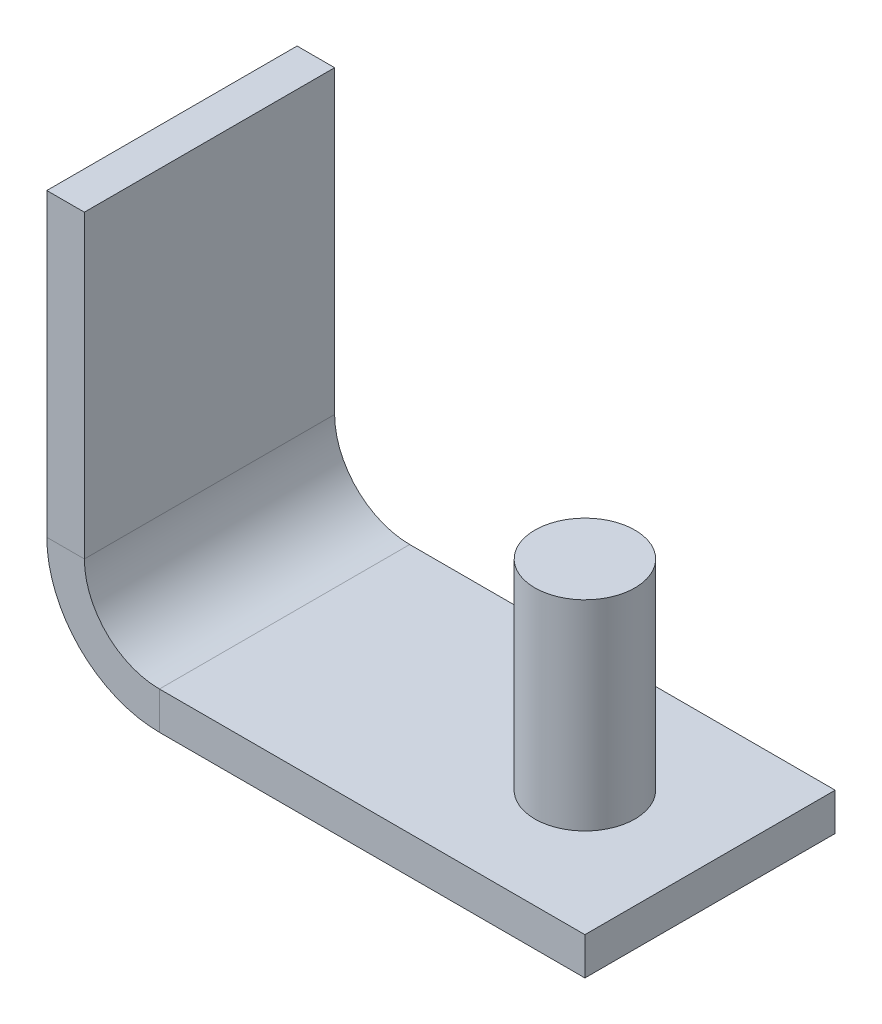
ISO-10303-21;
HEADER;
FILE_DESCRIPTION(('STEP AP214'),'2;1');
FILE_NAME('part.step','',(''),(''),'','','');
FILE_SCHEMA(('AUTOMOTIVE_DESIGN { 1 0 10303 214 1 1 1 1 }'));
ENDSEC;
DATA;
#1=APPLICATION_CONTEXT('core data for automotive mechanical design processes');
#2=APPLICATION_PROTOCOL_DEFINITION('international standard','automotive_design',2000,#1);
#3=PRODUCT_CONTEXT('',#1,'mechanical');
#4=PRODUCT('Part','Part','',(#3));
#5=PRODUCT_RELATED_PRODUCT_CATEGORY('part','',(#4));
#6=PRODUCT_DEFINITION_FORMATION('','',#4);
#7=PRODUCT_DEFINITION_CONTEXT('part definition',#1,'design');
#8=PRODUCT_DEFINITION('design','',#6,#7);
#9=PRODUCT_DEFINITION_SHAPE('','',#8);
#10=(LENGTH_UNIT() NAMED_UNIT(*) SI_UNIT(.MILLI.,.METRE.));
#11=(NAMED_UNIT(*) PLANE_ANGLE_UNIT() SI_UNIT($,.RADIAN.));
#12=(NAMED_UNIT(*) SI_UNIT($,.STERADIAN.) SOLID_ANGLE_UNIT());
#13=UNCERTAINTY_MEASURE_WITH_UNIT(LENGTH_MEASURE(1.E-05),#10,'distance_accuracy_value','');
#14=(GEOMETRIC_REPRESENTATION_CONTEXT(3) GLOBAL_UNCERTAINTY_ASSIGNED_CONTEXT((#13)) GLOBAL_UNIT_ASSIGNED_CONTEXT((#10,
#11,#12)) REPRESENTATION_CONTEXT('',''));
#15=CARTESIAN_POINT('',(0.,0.,0.));
#16=DIRECTION('',(0.,0.,1.));
#17=DIRECTION('',(1.,0.,0.));
#18=AXIS2_PLACEMENT_3D('',#15,#16,#17);
#19=CARTESIAN_POINT('',(6.00000000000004,0.,20.));
#20=DIRECTION('',(0.,0.,1.));
#21=DIRECTION('',(1.,0.,0.));
#22=AXIS2_PLACEMENT_3D('',#19,#20,#21);
#23=PLANE('',#22);
#24=DIRECTION('',(0.,-1.,0.));
#25=VECTOR('',#24,1.);
#26=CARTESIAN_POINT('',(6.00000000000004,0.,20.));
#27=LINE('',#26,#25);
#28=CARTESIAN_POINT('',(6.00000000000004,0.,20.));
#29=VERTEX_POINT('',#28);
#30=CARTESIAN_POINT('',(6.00000000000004,-3.,20.));
#31=VERTEX_POINT('',#30);
#32=EDGE_CURVE('E11',#29,#31,#27,.T.);
#33=ORIENTED_EDGE('',*,*,#32,.F.);
#34=CARTESIAN_POINT('',(6.,6.,20.));
#35=DIRECTION('',(0.,0.,1.));
#36=DIRECTION('',(-1.,0.,0.));
#37=AXIS2_PLACEMENT_3D('',#34,#35,#36);
#38=CIRCLE('',#37,6.);
#39=CARTESIAN_POINT('',(0.,6.00000000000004,20.));
#40=VERTEX_POINT('',#39);
#41=EDGE_CURVE('E133',#40,#29,#38,.T.);
#42=ORIENTED_EDGE('',*,*,#41,.F.);
#43=DIRECTION('',(1.,0.,0.));
#44=VECTOR('',#43,1.);
#45=CARTESIAN_POINT('',(-3.,6.00000000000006,20.));
#46=LINE('',#45,#44);
#47=CARTESIAN_POINT('',(-3.,6.00000000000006,20.));
#48=VERTEX_POINT('',#47);
#49=EDGE_CURVE('E44',#48,#40,#46,.T.);
#50=ORIENTED_EDGE('',*,*,#49,.F.);
#51=CARTESIAN_POINT('',(6.,6.,20.));
#52=DIRECTION('',(0.,0.,1.));
#53=DIRECTION('',(1.,0.,0.));
#54=AXIS2_PLACEMENT_3D('',#51,#52,#53);
#55=CIRCLE('',#54,9.);
#56=EDGE_CURVE('E126',#48,#31,#55,.T.);
#57=ORIENTED_EDGE('',*,*,#56,.T.);
#58=EDGE_LOOP('',(#33,#42,#50,#57));
#59=FACE_BOUND('',#58,.T.);
#60=ADVANCED_FACE('F36',(#59),#23,.T.);
#61=CARTESIAN_POINT('',(-3.,6.00000000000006,20.));
#62=DIRECTION('',(0.,0.,1.));
#63=DIRECTION('',(1.,0.,0.));
#64=AXIS2_PLACEMENT_3D('',#61,#62,#63);
#65=PLANE('',#64);
#66=DIRECTION('',(1.,0.,0.));
#67=VECTOR('',#66,1.);
#68=CARTESIAN_POINT('',(6.00000000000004,0.,20.));
#69=LINE('',#68,#67);
#70=CARTESIAN_POINT('',(40.,0.,20.));
#71=VERTEX_POINT('',#70);
#72=EDGE_CURVE('E183',#29,#71,#69,.T.);
#73=ORIENTED_EDGE('',*,*,#72,.F.);
#74=ORIENTED_EDGE('',*,*,#32,.T.);
#75=DIRECTION('',(1.,0.,0.));
#76=VECTOR('',#75,1.);
#77=CARTESIAN_POINT('',(6.00000000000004,-3.,20.));
#78=LINE('',#77,#76);
#79=CARTESIAN_POINT('',(40.,-3.,20.));
#80=VERTEX_POINT('',#79);
#81=EDGE_CURVE('E92',#31,#80,#78,.T.);
#82=ORIENTED_EDGE('',*,*,#81,.T.);
#83=DIRECTION('',(0.,-1.,0.));
#84=VECTOR('',#83,1.);
#85=CARTESIAN_POINT('',(40.,0.,20.));
#86=LINE('',#85,#84);
#87=EDGE_CURVE('E348',#71,#80,#86,.T.);
#88=ORIENTED_EDGE('',*,*,#87,.F.);
#89=EDGE_LOOP('',(#73,#74,#82,#88));
#90=FACE_BOUND('',#89,.T.);
#91=ADVANCED_FACE('F191',(#90),#65,.T.);
#92=CARTESIAN_POINT('',(0.,6.00000000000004,0.));
#93=DIRECTION('',(0.,0.,-1.));
#94=DIRECTION('',(-1.,0.,0.));
#95=AXIS2_PLACEMENT_3D('',#92,#93,#94);
#96=PLANE('',#95);
#97=DIRECTION('',(-1.,0.,0.));
#98=VECTOR('',#97,1.);
#99=CARTESIAN_POINT('',(0.,6.00000000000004,0.));
#100=LINE('',#99,#98);
#101=CARTESIAN_POINT('',(0.,6.00000000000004,0.));
#102=VERTEX_POINT('',#101);
#103=CARTESIAN_POINT('',(-3.,6.00000000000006,0.));
#104=VERTEX_POINT('',#103);
#105=EDGE_CURVE('E79',#102,#104,#100,.T.);
#106=ORIENTED_EDGE('',*,*,#105,.F.);
#107=CARTESIAN_POINT('',(6.,6.,0.));
#108=DIRECTION('',(0.,0.,1.));
#109=DIRECTION('',(-1.,0.,0.));
#110=AXIS2_PLACEMENT_3D('',#107,#108,#109);
#111=CIRCLE('',#110,6.);
#112=CARTESIAN_POINT('',(6.00000000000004,0.,0.));
#113=VERTEX_POINT('',#112);
#114=EDGE_CURVE('E149',#102,#113,#111,.T.);
#115=ORIENTED_EDGE('',*,*,#114,.T.);
#116=DIRECTION('',(0.,1.,0.));
#117=VECTOR('',#116,1.);
#118=CARTESIAN_POINT('',(6.00000000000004,-3.,0.));
#119=LINE('',#118,#117);
#120=CARTESIAN_POINT('',(6.00000000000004,-3.,0.));
#121=VERTEX_POINT('',#120);
#122=EDGE_CURVE('E86',#121,#113,#119,.T.);
#123=ORIENTED_EDGE('',*,*,#122,.F.);
#124=CARTESIAN_POINT('',(6.,6.,0.));
#125=DIRECTION('',(0.,0.,1.));
#126=DIRECTION('',(1.,0.,0.));
#127=AXIS2_PLACEMENT_3D('',#124,#125,#126);
#128=CIRCLE('',#127,9.);
#129=EDGE_CURVE('E156',#104,#121,#128,.T.);
#130=ORIENTED_EDGE('',*,*,#129,.F.);
#131=EDGE_LOOP('',(#106,#115,#123,#130));
#132=FACE_BOUND('',#131,.T.);
#133=ADVANCED_FACE('F189',(#132),#96,.T.);
#134=CARTESIAN_POINT('',(6.00000000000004,-3.,0.));
#135=DIRECTION('',(0.,0.,-1.));
#136=DIRECTION('',(-1.,0.,0.));
#137=AXIS2_PLACEMENT_3D('',#134,#135,#136);
#138=PLANE('',#137);
#139=DIRECTION('',(0.,-1.,0.));
#140=VECTOR('',#139,1.);
#141=CARTESIAN_POINT('',(0.,6.00000000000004,0.));
#142=LINE('',#141,#140);
#143=CARTESIAN_POINT('',(0.,30.,0.));
#144=VERTEX_POINT('',#143);
#145=EDGE_CURVE('E151',#144,#102,#142,.T.);
#146=ORIENTED_EDGE('',*,*,#145,.T.);
#147=ORIENTED_EDGE('',*,*,#105,.T.);
#148=DIRECTION('',(0.,1.,0.));
#149=VECTOR('',#148,1.);
#150=CARTESIAN_POINT('',(-3.,6.00000000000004,0.));
#151=LINE('',#150,#149);
#152=CARTESIAN_POINT('',(-3.,30.,0.));
#153=VERTEX_POINT('',#152);
#154=EDGE_CURVE('E154',#153,#104,#151,.F.);
#155=ORIENTED_EDGE('',*,*,#154,.F.);
#156=DIRECTION('',(1.,0.,0.));
#157=VECTOR('',#156,1.);
#158=CARTESIAN_POINT('',(-3.,30.,0.));
#159=LINE('',#158,#157);
#160=EDGE_CURVE('E114',#153,#144,#159,.T.);
#161=ORIENTED_EDGE('',*,*,#160,.T.);
#162=EDGE_LOOP('',(#146,#147,#155,#161));
#163=FACE_BOUND('',#162,.T.);
#164=ADVANCED_FACE('F185',(#163),#138,.T.);
#165=CARTESIAN_POINT('',(6.00000000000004,-3.,20.));
#166=DIRECTION('',(0.,1.,0.));
#167=DIRECTION('',(0.,0.,1.));
#168=AXIS2_PLACEMENT_3D('',#165,#166,#167);
#169=PLANE('',#168);
#170=DIRECTION('',(1.,0.,0.));
#171=VECTOR('',#170,1.);
#172=CARTESIAN_POINT('',(6.00000000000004,-3.,0.));
#173=LINE('',#172,#171);
#174=CARTESIAN_POINT('',(40.,-3.,0.));
#175=VERTEX_POINT('',#174);
#176=EDGE_CURVE('E139',#121,#175,#173,.T.);
#177=ORIENTED_EDGE('',*,*,#176,.T.);
#178=DIRECTION('',(0.,0.,-1.));
#179=VECTOR('',#178,1.);
#180=CARTESIAN_POINT('',(40.,-3.,20.));
#181=LINE('',#180,#179);
#182=EDGE_CURVE('E170',#80,#175,#181,.T.);
#183=ORIENTED_EDGE('',*,*,#182,.F.);
#184=ORIENTED_EDGE('',*,*,#81,.F.);
#185=DIRECTION('',(0.,0.,-1.));
#186=VECTOR('',#185,1.);
#187=CARTESIAN_POINT('',(6.00000000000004,-3.,20.));
#188=LINE('',#187,#186);
#189=EDGE_CURVE('E138',#31,#121,#188,.T.);
#190=ORIENTED_EDGE('',*,*,#189,.T.);
#191=EDGE_LOOP('',(#177,#183,#184,#190));
#192=FACE_BOUND('',#191,.T.);
#193=ADVANCED_FACE('F197',(#192),#169,.F.);
#194=CARTESIAN_POINT('',(40.,0.,20.));
#195=DIRECTION('',(1.,0.,0.));
#196=DIRECTION('',(0.,0.,-1.));
#197=AXIS2_PLACEMENT_3D('',#194,#195,#196);
#198=PLANE('',#197);
#199=DIRECTION('',(0.,-1.,0.));
#200=VECTOR('',#199,1.);
#201=CARTESIAN_POINT('',(40.,0.,0.));
#202=LINE('',#201,#200);
#203=CARTESIAN_POINT('',(40.,0.,0.));
#204=VERTEX_POINT('',#203);
#205=EDGE_CURVE('E142',#204,#175,#202,.T.);
#206=ORIENTED_EDGE('',*,*,#205,.F.);
#207=DIRECTION('',(0.,0.,-1.));
#208=VECTOR('',#207,1.);
#209=CARTESIAN_POINT('',(40.,0.,20.));
#210=LINE('',#209,#208);
#211=EDGE_CURVE('E168',#71,#204,#210,.T.);
#212=ORIENTED_EDGE('',*,*,#211,.F.);
#213=ORIENTED_EDGE('',*,*,#87,.T.);
#214=ORIENTED_EDGE('',*,*,#182,.T.);
#215=EDGE_LOOP('',(#206,#212,#213,#214));
#216=FACE_BOUND('',#215,.T.);
#217=ADVANCED_FACE('F228',(#216),#198,.T.);
#218=CARTESIAN_POINT('',(6.00000000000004,0.,20.));
#219=DIRECTION('',(0.,1.,0.));
#220=DIRECTION('',(0.,0.,1.));
#221=AXIS2_PLACEMENT_3D('',#218,#219,#220);
#222=PLANE('',#221);
#223=CARTESIAN_POINT('',(30.,0.,10.));
#224=DIRECTION('',(0.,1.,0.));
#225=DIRECTION('',(0.,0.,1.));
#226=AXIS2_PLACEMENT_3D('',#223,#224,#225);
#227=CIRCLE('',#226,4.);
#228=CARTESIAN_POINT('',(30.,0.,14.));
#229=VERTEX_POINT('',#228);
#230=EDGE_CURVE('E342',#229,#229,#227,.T.);
#231=ORIENTED_EDGE('',*,*,#230,.F.);
#232=EDGE_LOOP('',(#231));
#233=FACE_BOUND('',#232,.T.);
#234=DIRECTION('',(1.,0.,0.));
#235=VECTOR('',#234,1.);
#236=CARTESIAN_POINT('',(6.00000000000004,0.,0.));
#237=LINE('',#236,#235);
#238=EDGE_CURVE('E146',#113,#204,#237,.T.);
#239=ORIENTED_EDGE('',*,*,#238,.F.);
#240=DIRECTION('',(0.,0.,-1.));
#241=VECTOR('',#240,1.);
#242=CARTESIAN_POINT('',(6.00000000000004,0.,20.));
#243=LINE('',#242,#241);
#244=EDGE_CURVE('E165',#29,#113,#243,.T.);
#245=ORIENTED_EDGE('',*,*,#244,.F.);
#246=ORIENTED_EDGE('',*,*,#72,.T.);
#247=ORIENTED_EDGE('',*,*,#211,.T.);
#248=EDGE_LOOP('',(#239,#245,#246,#247));
#249=FACE_BOUND('',#248,.T.);
#250=ADVANCED_FACE('F239',(#233,#249),#222,.T.);
#251=CARTESIAN_POINT('',(6.,6.,20.));
#252=DIRECTION('',(0.,0.,-1.));
#253=DIRECTION('',(-1.,0.,0.));
#254=AXIS2_PLACEMENT_3D('',#251,#252,#253);
#255=CYLINDRICAL_SURFACE('',#254,6.);
#256=ORIENTED_EDGE('',*,*,#114,.F.);
#257=DIRECTION('',(0.,0.,-1.));
#258=VECTOR('',#257,1.);
#259=CARTESIAN_POINT('',(0.,6.00000000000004,20.));
#260=LINE('',#259,#258);
#261=EDGE_CURVE('E162',#40,#102,#260,.T.);
#262=ORIENTED_EDGE('',*,*,#261,.F.);
#263=ORIENTED_EDGE('',*,*,#41,.T.);
#264=ORIENTED_EDGE('',*,*,#244,.T.);
#265=EDGE_LOOP('',(#256,#262,#263,#264));
#266=FACE_BOUND('',#265,.T.);
#267=ADVANCED_FACE('F179',(#266),#255,.F.);
#268=CARTESIAN_POINT('',(0.,6.00000000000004,20.));
#269=DIRECTION('',(1.,0.,0.));
#270=DIRECTION('',(0.,0.,-1.));
#271=AXIS2_PLACEMENT_3D('',#268,#269,#270);
#272=PLANE('',#271);
#273=ORIENTED_EDGE('',*,*,#145,.F.);
#274=DIRECTION('',(0.,0.,-1.));
#275=VECTOR('',#274,1.);
#276=CARTESIAN_POINT('',(0.,30.,20.));
#277=LINE('',#276,#275);
#278=CARTESIAN_POINT('',(0.,30.,20.));
#279=VERTEX_POINT('',#278);
#280=EDGE_CURVE('E116',#279,#144,#277,.T.);
#281=ORIENTED_EDGE('',*,*,#280,.F.);
#282=DIRECTION('',(0.,-1.,0.));
#283=VECTOR('',#282,1.);
#284=CARTESIAN_POINT('',(0.,6.00000000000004,20.));
#285=LINE('',#284,#283);
#286=EDGE_CURVE('E131',#279,#40,#285,.T.);
#287=ORIENTED_EDGE('',*,*,#286,.T.);
#288=ORIENTED_EDGE('',*,*,#261,.T.);
#289=EDGE_LOOP('',(#273,#281,#287,#288));
#290=FACE_BOUND('',#289,.T.);
#291=ADVANCED_FACE('F184',(#290),#272,.T.);
#292=CARTESIAN_POINT('',(-3.,30.,20.));
#293=DIRECTION('',(0.,1.,0.));
#294=DIRECTION('',(0.,0.,1.));
#295=AXIS2_PLACEMENT_3D('',#292,#293,#294);
#296=PLANE('',#295);
#297=ORIENTED_EDGE('',*,*,#160,.F.);
#298=DIRECTION('',(0.,0.,-1.));
#299=VECTOR('',#298,1.);
#300=CARTESIAN_POINT('',(-3.,30.,20.));
#301=LINE('',#300,#299);
#302=CARTESIAN_POINT('',(-3.,30.,20.));
#303=VERTEX_POINT('',#302);
#304=EDGE_CURVE('E108',#303,#153,#301,.T.);
#305=ORIENTED_EDGE('',*,*,#304,.F.);
#306=DIRECTION('',(1.,0.,0.));
#307=VECTOR('',#306,1.);
#308=CARTESIAN_POINT('',(-3.,30.,20.));
#309=LINE('',#308,#307);
#310=EDGE_CURVE('E112',#303,#279,#309,.T.);
#311=ORIENTED_EDGE('',*,*,#310,.T.);
#312=ORIENTED_EDGE('',*,*,#280,.T.);
#313=EDGE_LOOP('',(#297,#305,#311,#312));
#314=FACE_BOUND('',#313,.T.);
#315=ADVANCED_FACE('F110',(#314),#296,.T.);
#316=CARTESIAN_POINT('',(-3.,6.00000000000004,20.));
#317=DIRECTION('',(1.,0.,0.));
#318=DIRECTION('',(0.,0.,-1.));
#319=AXIS2_PLACEMENT_3D('',#316,#317,#318);
#320=PLANE('',#319);
#321=ORIENTED_EDGE('',*,*,#154,.T.);
#322=DIRECTION('',(0.,0.,-1.));
#323=VECTOR('',#322,1.);
#324=CARTESIAN_POINT('',(-3.,6.00000000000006,20.));
#325=LINE('',#324,#323);
#326=EDGE_CURVE('E117',#48,#104,#325,.T.);
#327=ORIENTED_EDGE('',*,*,#326,.F.);
#328=DIRECTION('',(0.,1.,0.));
#329=VECTOR('',#328,1.);
#330=CARTESIAN_POINT('',(-3.,6.00000000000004,20.));
#331=LINE('',#330,#329);
#332=EDGE_CURVE('E121',#303,#48,#331,.F.);
#333=ORIENTED_EDGE('',*,*,#332,.F.);
#334=ORIENTED_EDGE('',*,*,#304,.T.);
#335=EDGE_LOOP('',(#321,#327,#333,#334));
#336=FACE_BOUND('',#335,.T.);
#337=ADVANCED_FACE('F122',(#336),#320,.F.);
#338=CARTESIAN_POINT('',(6.,6.,20.));
#339=DIRECTION('',(0.,0.,-1.));
#340=DIRECTION('',(-1.,0.,0.));
#341=AXIS2_PLACEMENT_3D('',#338,#339,#340);
#342=CYLINDRICAL_SURFACE('',#341,9.);
#343=ORIENTED_EDGE('',*,*,#129,.T.);
#344=ORIENTED_EDGE('',*,*,#189,.F.);
#345=ORIENTED_EDGE('',*,*,#56,.F.);
#346=ORIENTED_EDGE('',*,*,#326,.T.);
#347=EDGE_LOOP('',(#343,#344,#345,#346));
#348=FACE_BOUND('',#347,.T.);
#349=ADVANCED_FACE('F187',(#348),#342,.T.);
#350=CARTESIAN_POINT('',(6.,6.,20.));
#351=DIRECTION('',(0.,0.,1.));
#352=DIRECTION('',(1.,0.,0.));
#353=AXIS2_PLACEMENT_3D('',#350,#351,#352);
#354=PLANE('',#353);
#355=ORIENTED_EDGE('',*,*,#332,.T.);
#356=ORIENTED_EDGE('',*,*,#49,.T.);
#357=ORIENTED_EDGE('',*,*,#286,.F.);
#358=ORIENTED_EDGE('',*,*,#310,.F.);
#359=EDGE_LOOP('',(#355,#356,#357,#358));
#360=FACE_BOUND('',#359,.T.);
#361=ADVANCED_FACE('F129',(#360),#354,.T.);
#362=CARTESIAN_POINT('',(6.,6.,0.));
#363=DIRECTION('',(0.,0.,1.));
#364=DIRECTION('',(1.,0.,0.));
#365=AXIS2_PLACEMENT_3D('',#362,#363,#364);
#366=PLANE('',#365);
#367=ORIENTED_EDGE('',*,*,#176,.F.);
#368=ORIENTED_EDGE('',*,*,#122,.T.);
#369=ORIENTED_EDGE('',*,*,#238,.T.);
#370=ORIENTED_EDGE('',*,*,#205,.T.);
#371=EDGE_LOOP('',(#367,#368,#369,#370));
#372=FACE_BOUND('',#371,.T.);
#373=ADVANCED_FACE('F297',(#372),#366,.F.);
#374=CARTESIAN_POINT('',(30.,16.,10.));
#375=DIRECTION('',(0.,-1.,0.));
#376=DIRECTION('',(0.,0.,-1.));
#377=AXIS2_PLACEMENT_3D('',#374,#375,#376);
#378=CYLINDRICAL_SURFACE('',#377,4.);
#379=CARTESIAN_POINT('',(30.,16.,10.));
#380=DIRECTION('',(0.,1.,0.));
#381=DIRECTION('',(0.,0.,1.));
#382=AXIS2_PLACEMENT_3D('',#379,#380,#381);
#383=CIRCLE('',#382,4.);
#384=CARTESIAN_POINT('',(30.,16.,14.));
#385=VERTEX_POINT('',#384);
#386=EDGE_CURVE('E143',#385,#385,#383,.T.);
#387=ORIENTED_EDGE('',*,*,#386,.F.);
#388=EDGE_LOOP('',(#387));
#389=FACE_BOUND('',#388,.T.);
#390=ORIENTED_EDGE('',*,*,#230,.T.);
#391=EDGE_LOOP('',(#390));
#392=FACE_BOUND('',#391,.T.);
#393=ADVANCED_FACE('F307',(#389,#392),#378,.T.);
#394=CARTESIAN_POINT('',(30.,16.,10.));
#395=DIRECTION('',(0.,1.,0.));
#396=DIRECTION('',(0.,0.,1.));
#397=AXIS2_PLACEMENT_3D('',#394,#395,#396);
#398=PLANE('',#397);
#399=ORIENTED_EDGE('',*,*,#386,.T.);
#400=EDGE_LOOP('',(#399));
#401=FACE_BOUND('',#400,.T.);
#402=ADVANCED_FACE('F326',(#401),#398,.T.);
#403=CLOSED_SHELL('',(#60,#91,#133,#164,#193,#217,#250,#267,#291,#315,#337,#349,#361,#373,#393,#402));
#404=MANIFOLD_SOLID_BREP('B2',#403);
#405=ADVANCED_BREP_SHAPE_REPRESENTATION('',(#18,#404),#14);
#406=SHAPE_DEFINITION_REPRESENTATION(#9,#405);
ENDSEC;
END-ISO-10303-21;
